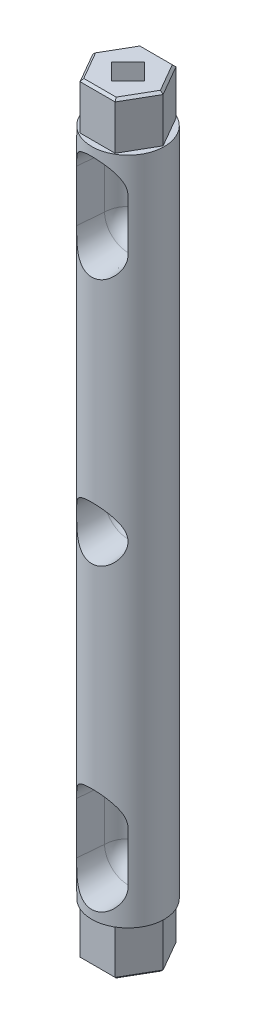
from build123d import *

# Parameters (mm, degrees)
SKETCH1_R                       = 7.75
BOSS_EXTRUDE1_DEPTH             = 143
SKETCH2_R                       = 5
CUT_EXTRUDE1_DEPTH              = 144.419402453
CUT_EXTRUDE1_TAPER              = -5
BOSS_EXTRUDE2_DEPTH             = 10
BOSS_EXTRUDE3_DEPTH             = 10
F_12_0_189_DIAMETER_HOLE1_D     = 4.8006
F_12_0_189_DIAMETER_HOLE1_DEPTH = 5
F_12_0_189_DIAMETER_HOLE1_TIP   = 1.442245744
F_12_0_189_DIAMETER_HOLE2_D     = 4.8006
F_12_0_189_DIAMETER_HOLE2_DEPTH = 5
F_12_0_189_DIAMETER_HOLE2_TIP   = 1.442245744
CUT_EXTRUDE2_DEPTH              = 10
CUT_EXTRUDE3_DEPTH              = 10
CHAMFER1_SIZE                   = 0.5
CHAMFER2_SIZE                   = 0.5


with BuildPart() as part:
    # Sketch1 → Boss-Extrude1 (new body)
    with BuildSketch(Plane(origin=(0, 0, 0), x_dir=(1, 0, 0), z_dir=(0, 1, 0))):
        with Locations(Location((0, 0, 0), (0, 0, 270))):
            Circle(SKETCH1_R)
    extrude(amount=BOSS_EXTRUDE1_DEPTH)

    # Sketch2 → Cut-Extrude1 (cut, through all)
    with BuildSketch(Plane.XY):
        with Locations((0, 71.5)):
            Circle(SKETCH2_R)
        with BuildLine():
            Line((-5, 135.5), (-5, 125.5))
            Line((-5, 125.5), (-5, 124.5))
            ThreePointArc((-5, 124.5), (0, 119.5), (5, 124.5))
            Line((5, 124.5), (5, 125.5))
            Line((5, 125.5), (5, 135.5))
            ThreePointArc((5, 135.5), (0, 140.5), (-5, 135.5))
        make_face()
        with BuildLine():
            Line((-5, 17.5), (-5, 7.5))
            ThreePointArc((-5, 7.5), (0, 2.5), (5, 7.5))
            Line((5, 7.5), (5, 17.5))
            Line((5, 17.5), (5, 18.5))
            ThreePointArc((5, 18.5), (0, 23.5), (-5, 18.5))
            Line((-5, 18.5), (-5, 17.5))
        make_face()
    extrude(amount=CUT_EXTRUDE1_DEPTH, taper=CUT_EXTRUDE1_TAPER, mode=Mode.SUBTRACT)

    # Sketch3 → Cut-Revolve1 (revolve, cut)
    with BuildSketch(Plane.XY):
        with BuildLine():
            Line((0, 140.5), (0, 130))
            Line((0, 130), (0, 119.5))
            ThreePointArc((0, 119.5), (3.535533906, 120.964466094), (5, 124.5))
            Line((5, 124.5), (5, 135.5))
            ThreePointArc((5, 135.5), (3.535533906, 139.035533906), (0, 140.5))
        make_face()
        with BuildLine():
            Line((0, 7.5), (0, 23.5))
            ThreePointArc((0, 23.5), (3.535533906, 22.035533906), (5, 18.5))
            Line((5, 18.5), (5, 7.5))
            ThreePointArc((5, 7.5), (3.535533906, 3.964466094), (0, 2.5))
            Line((0, 2.5), (0, 7.5))
        make_face()
        with BuildLine():
            Line((0, 76.5), (0, 66.5))
            ThreePointArc((0, 66.5), (5, 71.5), (0, 76.5))
        make_face()
    revolve(axis=Axis((0, 143, 0), (0, -1, 0)), mode=Mode.SUBTRACT)

    # Sketch4 → Boss-Extrude2 (add)
    with BuildSketch(Plane(origin=(0, 143, 0), x_dir=(1, 0, 0), z_dir=(0, 1, 0))):
        Polygon((7.5, 0), (3.75, 6.495190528), (-3.75, 6.495190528), (-7.5, 0), (-3.75, -6.495190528), (3.75, -6.495190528), align=None)
    extrude(amount=BOSS_EXTRUDE2_DEPTH)

    # Sketch5 → Boss-Extrude3 (add)
    with BuildSketch(Plane(origin=(0, 0, 0), x_dir=(-1, 0, 0), z_dir=(0, -1, 0))):
        Polygon((-7.5, 0), (-3.75, -6.495190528), (3.75, -6.495190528), (7.5, 0), (3.75, 6.495190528), (-3.75, 6.495190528), align=None)
    extrude(amount=BOSS_EXTRUDE3_DEPTH)

    # 12 _0.189_ Diameter Hole1
    with Locations(Plane(origin=(0, 153, 0), x_dir=(1, 0, 0), z_dir=(0, 1, 0))):
        with Locations((0, 0)):
            Hole(F_12_0_189_DIAMETER_HOLE1_D / 2, depth=F_12_0_189_DIAMETER_HOLE1_DEPTH)
            with Locations((0, 0, -(F_12_0_189_DIAMETER_HOLE1_DEPTH + F_12_0_189_DIAMETER_HOLE1_TIP / 2))):  # 118° drill point
                Cone(0, F_12_0_189_DIAMETER_HOLE1_D / 2, F_12_0_189_DIAMETER_HOLE1_TIP, mode=Mode.SUBTRACT)

    # 12 _0.189_ Diameter Hole2
    with Locations(Plane(origin=(0, -10, 0), x_dir=(-1, 0, 0), z_dir=(0, -1, 0))):
        with Locations((0, 0)):
            Hole(F_12_0_189_DIAMETER_HOLE2_D / 2, depth=F_12_0_189_DIAMETER_HOLE2_DEPTH)
            with Locations((0, 0, -(F_12_0_189_DIAMETER_HOLE2_DEPTH + F_12_0_189_DIAMETER_HOLE2_TIP / 2))):  # 118° drill point
                Cone(0, F_12_0_189_DIAMETER_HOLE2_D / 2, F_12_0_189_DIAMETER_HOLE2_TIP, mode=Mode.SUBTRACT)

    # Sketch11 → Cut-Extrude2 (cut)
    with BuildSketch(Plane(origin=(0, 153, 0), x_dir=(1, 0, 0), z_dir=(0, 1, 0))):
        Polygon((0, 3.487644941), (3.487644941, 0), (0, -3.487644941), (-3.487644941, 0), align=None)
    extrude(amount=-CUT_EXTRUDE2_DEPTH, mode=Mode.SUBTRACT)

    # Sketch12 → Cut-Extrude3 (cut)
    with BuildSketch(Plane(origin=(0, -10, 0), x_dir=(-1, 0, 0), z_dir=(0, -1, 0))):
        Polygon((0, -3.487644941), (-3.487644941, 0), (0, 3.487644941), (3.487644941, 0), align=None)
    extrude(amount=-CUT_EXTRUDE3_DEPTH, mode=Mode.SUBTRACT)

    # Chamfer1
    chamfer1_edges = [part.edges().sort_by_distance(p)[0] for p in [
        (5.625, 153, 3.247595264),
        (5.625, 153, -3.247595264),
        (0, 153, -6.495190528),
        (-5.625, 153, -3.247595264),
        (-5.625, 153, 3.247595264),
        (0, 153, 6.495190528),
    ]]
    chamfer(chamfer1_edges, length=CHAMFER1_SIZE)

    # Chamfer2
    chamfer2_edges = [part.edges().sort_by_distance(p)[0] for p in [
        (5.625, -10, -3.247595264),
        (5.625, -10, 3.247595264),
        (0, -10, 6.495190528),
        (-5.625, -10, 3.247595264),
        (-5.625, -10, -3.247595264),
        (0, -10, -6.495190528),
    ]]
    chamfer(chamfer2_edges, length=CHAMFER2_SIZE)


solid = part.part
